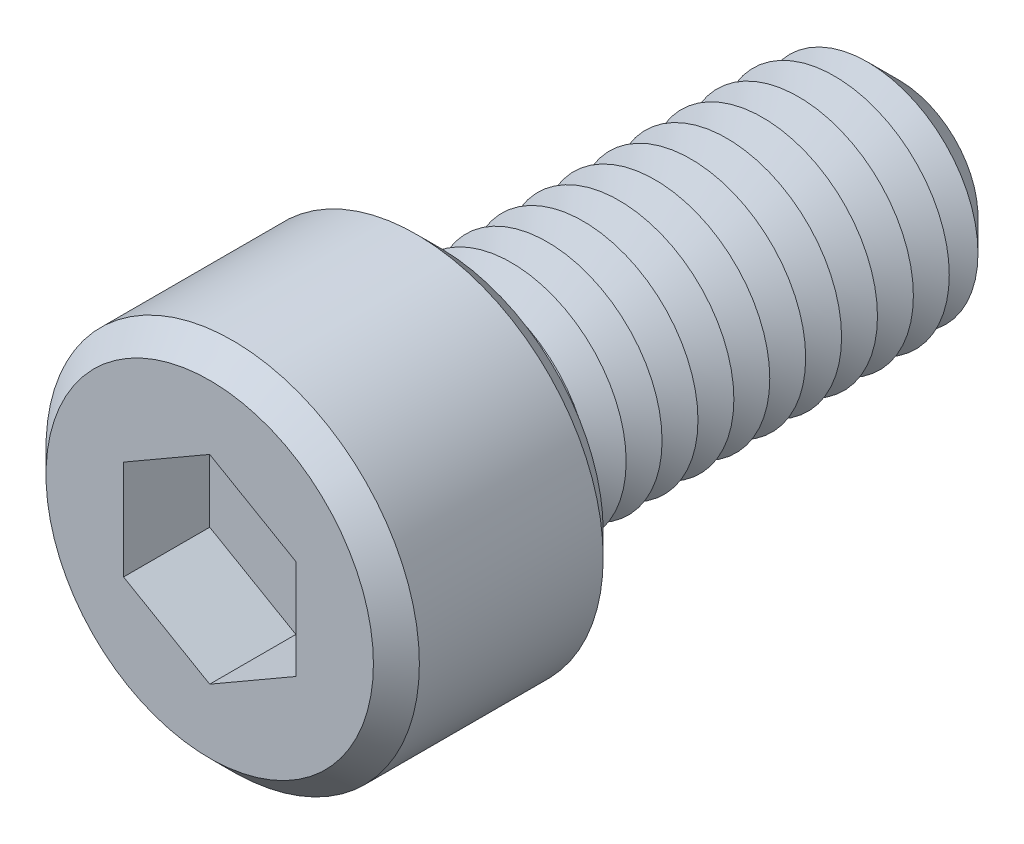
ISO-10303-21;
HEADER;
FILE_DESCRIPTION(('STEP AP214'),'2;1');
FILE_NAME('part.step','',(''),(''),'','','');
FILE_SCHEMA(('AUTOMOTIVE_DESIGN { 1 0 10303 214 1 1 1 1 }'));
ENDSEC;
DATA;
#1=APPLICATION_CONTEXT('core data for automotive mechanical design processes');
#2=APPLICATION_PROTOCOL_DEFINITION('international standard','automotive_design',2000,#1);
#3=PRODUCT_CONTEXT('',#1,'mechanical');
#4=PRODUCT('Part','Part','',(#3));
#5=PRODUCT_RELATED_PRODUCT_CATEGORY('part','',(#4));
#6=PRODUCT_DEFINITION_FORMATION('','',#4);
#7=PRODUCT_DEFINITION_CONTEXT('part definition',#1,'design');
#8=PRODUCT_DEFINITION('design','',#6,#7);
#9=PRODUCT_DEFINITION_SHAPE('','',#8);
#10=(LENGTH_UNIT() NAMED_UNIT(*) SI_UNIT(.MILLI.,.METRE.));
#11=(NAMED_UNIT(*) PLANE_ANGLE_UNIT() SI_UNIT($,.RADIAN.));
#12=(NAMED_UNIT(*) SI_UNIT($,.STERADIAN.) SOLID_ANGLE_UNIT());
#13=UNCERTAINTY_MEASURE_WITH_UNIT(LENGTH_MEASURE(1.E-05),#10,'distance_accuracy_value','');
#14=(GEOMETRIC_REPRESENTATION_CONTEXT(3) GLOBAL_UNCERTAINTY_ASSIGNED_CONTEXT((#13)) GLOBAL_UNIT_ASSIGNED_CONTEXT((#10,
#11,#12)) REPRESENTATION_CONTEXT('',''));
#15=CARTESIAN_POINT('',(0.,0.,0.));
#16=DIRECTION('',(0.,0.,1.));
#17=DIRECTION('',(1.,0.,0.));
#18=AXIS2_PLACEMENT_3D('',#15,#16,#17);
#19=CARTESIAN_POINT('',(0.,0.,8.));
#20=DIRECTION('',(0.,0.,-1.));
#21=DIRECTION('',(-1.,0.,0.));
#22=AXIS2_PLACEMENT_3D('',#19,#20,#21);
#23=CYLINDRICAL_SURFACE('',#22,6.5);
#24=CARTESIAN_POINT('',(0.,0.,0.800000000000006));
#25=DIRECTION('',(0.,0.,1.));
#26=DIRECTION('',(1.,0.,0.));
#27=AXIS2_PLACEMENT_3D('',#24,#25,#26);
#28=CIRCLE('',#27,6.5);
#29=CARTESIAN_POINT('',(6.5,0.,0.800000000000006));
#30=VERTEX_POINT('',#29);
#31=EDGE_CURVE('E272',#30,#30,#28,.T.);
#32=ORIENTED_EDGE('',*,*,#31,.T.);
#33=EDGE_LOOP('',(#32));
#34=FACE_BOUND('',#33,.T.);
#35=CARTESIAN_POINT('',(0.,0.,7.2));
#36=DIRECTION('',(0.,0.,1.));
#37=DIRECTION('',(1.,0.,0.));
#38=AXIS2_PLACEMENT_3D('',#35,#36,#37);
#39=CIRCLE('',#38,6.5);
#40=CARTESIAN_POINT('',(6.5,0.,7.2));
#41=VERTEX_POINT('',#40);
#42=EDGE_CURVE('E265',#41,#41,#39,.F.);
#43=ORIENTED_EDGE('',*,*,#42,.T.);
#44=EDGE_LOOP('',(#43));
#45=FACE_BOUND('',#44,.T.);
#46=ADVANCED_FACE('F39',(#34,#45),#23,.T.);
#47=CARTESIAN_POINT('',(0.,0.,8.));
#48=DIRECTION('',(0.,0.,1.));
#49=DIRECTION('',(1.,0.,0.));
#50=AXIS2_PLACEMENT_3D('',#47,#48,#49);
#51=PLANE('',#50);
#52=CARTESIAN_POINT('',(0.,0.,8.));
#53=DIRECTION('',(0.,0.,1.));
#54=DIRECTION('',(1.,0.,0.));
#55=AXIS2_PLACEMENT_3D('',#52,#53,#54);
#56=CIRCLE('',#55,5.70000000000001);
#57=CARTESIAN_POINT('',(5.70000000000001,0.,8.));
#58=VERTEX_POINT('',#57);
#59=EDGE_CURVE('E11',#58,#58,#56,.T.);
#60=ORIENTED_EDGE('',*,*,#59,.T.);
#61=EDGE_LOOP('',(#60));
#62=FACE_BOUND('',#61,.T.);
#63=DIRECTION('',(-0.866025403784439,0.5,0.));
#64=VECTOR('',#63,1.);
#65=CARTESIAN_POINT('',(3.,1.73205080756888,8.));
#66=LINE('',#65,#64);
#67=CARTESIAN_POINT('',(3.,1.73205080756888,8.));
#68=VERTEX_POINT('',#67);
#69=CARTESIAN_POINT('',(0.,3.46410161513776,8.));
#70=VERTEX_POINT('',#69);
#71=EDGE_CURVE('E55',#68,#70,#66,.T.);
#72=ORIENTED_EDGE('',*,*,#71,.F.);
#73=DIRECTION('',(0.,1.,0.));
#74=VECTOR('',#73,1.);
#75=CARTESIAN_POINT('',(3.,-1.73205080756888,8.));
#76=LINE('',#75,#74);
#77=CARTESIAN_POINT('',(3.,-1.73205080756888,8.));
#78=VERTEX_POINT('',#77);
#79=EDGE_CURVE('E150',#78,#68,#76,.T.);
#80=ORIENTED_EDGE('',*,*,#79,.F.);
#81=DIRECTION('',(0.866025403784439,0.5,0.));
#82=VECTOR('',#81,1.);
#83=CARTESIAN_POINT('',(0.,-3.46410161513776,8.));
#84=LINE('',#83,#82);
#85=CARTESIAN_POINT('',(0.,-3.46410161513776,8.));
#86=VERTEX_POINT('',#85);
#87=EDGE_CURVE('E147',#86,#78,#84,.T.);
#88=ORIENTED_EDGE('',*,*,#87,.F.);
#89=DIRECTION('',(0.866025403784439,-0.5,0.));
#90=VECTOR('',#89,1.);
#91=CARTESIAN_POINT('',(-3.,-1.73205080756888,8.));
#92=LINE('',#91,#90);
#93=CARTESIAN_POINT('',(-3.,-1.73205080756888,8.));
#94=VERTEX_POINT('',#93);
#95=EDGE_CURVE('E103',#94,#86,#92,.T.);
#96=ORIENTED_EDGE('',*,*,#95,.F.);
#97=DIRECTION('',(0.,-1.,0.));
#98=VECTOR('',#97,1.);
#99=CARTESIAN_POINT('',(-3.,1.73205080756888,8.));
#100=LINE('',#99,#98);
#101=CARTESIAN_POINT('',(-3.,1.73205080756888,8.));
#102=VERTEX_POINT('',#101);
#103=EDGE_CURVE('E141',#102,#94,#100,.T.);
#104=ORIENTED_EDGE('',*,*,#103,.F.);
#105=DIRECTION('',(-0.866025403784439,-0.5,0.));
#106=VECTOR('',#105,1.);
#107=CARTESIAN_POINT('',(0.,3.46410161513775,8.));
#108=LINE('',#107,#106);
#109=EDGE_CURVE('E136',#70,#102,#108,.T.);
#110=ORIENTED_EDGE('',*,*,#109,.F.);
#111=EDGE_LOOP('',(#72,#80,#88,#96,#104,#110));
#112=FACE_BOUND('',#111,.T.);
#113=ADVANCED_FACE('F290',(#62,#112),#51,.T.);
#114=CARTESIAN_POINT('',(0.,0.,0.));
#115=DIRECTION('',(0.,0.,1.));
#116=DIRECTION('',(1.,0.,0.));
#117=AXIS2_PLACEMENT_3D('',#114,#115,#116);
#118=PLANE('',#117);
#119=CARTESIAN_POINT('',(0.,0.,0.));
#120=DIRECTION('',(0.,0.,1.));
#121=DIRECTION('',(1.,0.,0.));
#122=AXIS2_PLACEMENT_3D('',#119,#120,#121);
#123=CIRCLE('',#122,5.69999999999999);
#124=CARTESIAN_POINT('',(5.69999999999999,0.,0.));
#125=VERTEX_POINT('',#124);
#126=EDGE_CURVE('E48',#125,#125,#123,.F.);
#127=ORIENTED_EDGE('',*,*,#126,.T.);
#128=EDGE_LOOP('',(#127));
#129=FACE_BOUND('',#128,.T.);
#130=CARTESIAN_POINT('',(0.,0.,0.));
#131=DIRECTION('',(0.,0.,1.));
#132=DIRECTION('',(1.,0.,0.));
#133=AXIS2_PLACEMENT_3D('',#130,#131,#132);
#134=CIRCLE('',#133,4.);
#135=CARTESIAN_POINT('',(4.,0.,0.));
#136=VERTEX_POINT('',#135);
#137=EDGE_CURVE('E258',#136,#136,#134,.T.);
#138=ORIENTED_EDGE('',*,*,#137,.T.);
#139=EDGE_LOOP('',(#138));
#140=FACE_BOUND('',#139,.T.);
#141=ADVANCED_FACE('F279',(#129,#140),#118,.F.);
#142=CARTESIAN_POINT('',(0.,0.,0.));
#143=DIRECTION('',(0.,0.,1.));
#144=DIRECTION('',(1.,0.,0.));
#145=AXIS2_PLACEMENT_3D('',#142,#143,#144);
#146=CONICAL_SURFACE('',#145,4.,1.0471975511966);
#147=CARTESIAN_POINT('',(0.,0.,-0.625000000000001));
#148=DIRECTION('',(0.,0.,1.));
#149=DIRECTION('',(1.,0.,0.));
#150=AXIS2_PLACEMENT_3D('',#147,#148,#149);
#151=CIRCLE('',#150,2.91746824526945);
#152=CARTESIAN_POINT('',(2.91746824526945,0.,-0.625000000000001));
#153=VERTEX_POINT('',#152);
#154=EDGE_CURVE('E254',#153,#153,#151,.T.);
#155=ORIENTED_EDGE('',*,*,#154,.T.);
#156=EDGE_LOOP('',(#155));
#157=FACE_BOUND('',#156,.T.);
#158=ORIENTED_EDGE('',*,*,#137,.F.);
#159=EDGE_LOOP('',(#158));
#160=FACE_BOUND('',#159,.T.);
#161=ADVANCED_FACE('F436',(#157,#160),#146,.T.);
#162=CARTESIAN_POINT('',(0.,0.,-0.625000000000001));
#163=DIRECTION('',(0.,0.,-1.));
#164=DIRECTION('',(-1.,0.,0.));
#165=AXIS2_PLACEMENT_3D('',#162,#163,#164);
#166=CONICAL_SURFACE('',#165,2.91746824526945,1.0471975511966);
#167=CARTESIAN_POINT('',(0.,0.,-1.25));
#168=DIRECTION('',(0.,0.,1.));
#169=DIRECTION('',(1.,0.,0.));
#170=AXIS2_PLACEMENT_3D('',#167,#168,#169);
#171=CIRCLE('',#170,4.);
#172=CARTESIAN_POINT('',(4.,0.,-1.25));
#173=VERTEX_POINT('',#172);
#174=EDGE_CURVE('E250',#173,#173,#171,.T.);
#175=ORIENTED_EDGE('',*,*,#174,.T.);
#176=EDGE_LOOP('',(#175));
#177=FACE_BOUND('',#176,.T.);
#178=ORIENTED_EDGE('',*,*,#154,.F.);
#179=EDGE_LOOP('',(#178));
#180=FACE_BOUND('',#179,.T.);
#181=ADVANCED_FACE('F432',(#177,#180),#166,.T.);
#182=CARTESIAN_POINT('',(0.,0.,-1.25));
#183=DIRECTION('',(0.,0.,1.));
#184=DIRECTION('',(1.,0.,0.));
#185=AXIS2_PLACEMENT_3D('',#182,#183,#184);
#186=CONICAL_SURFACE('',#185,4.,1.0471975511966);
#187=CARTESIAN_POINT('',(0.,0.,-1.875));
#188=DIRECTION('',(0.,0.,1.));
#189=DIRECTION('',(1.,0.,0.));
#190=AXIS2_PLACEMENT_3D('',#187,#188,#189);
#191=CIRCLE('',#190,2.91746824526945);
#192=CARTESIAN_POINT('',(2.91746824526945,0.,-1.875));
#193=VERTEX_POINT('',#192);
#194=EDGE_CURVE('E246',#193,#193,#191,.T.);
#195=ORIENTED_EDGE('',*,*,#194,.T.);
#196=EDGE_LOOP('',(#195));
#197=FACE_BOUND('',#196,.T.);
#198=ORIENTED_EDGE('',*,*,#174,.F.);
#199=EDGE_LOOP('',(#198));
#200=FACE_BOUND('',#199,.T.);
#201=ADVANCED_FACE('F428',(#197,#200),#186,.T.);
#202=CARTESIAN_POINT('',(0.,0.,-1.875));
#203=DIRECTION('',(0.,0.,-1.));
#204=DIRECTION('',(-1.,0.,0.));
#205=AXIS2_PLACEMENT_3D('',#202,#203,#204);
#206=CONICAL_SURFACE('',#205,2.91746824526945,1.0471975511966);
#207=CARTESIAN_POINT('',(0.,0.,-2.5));
#208=DIRECTION('',(0.,0.,1.));
#209=DIRECTION('',(1.,0.,0.));
#210=AXIS2_PLACEMENT_3D('',#207,#208,#209);
#211=CIRCLE('',#210,4.);
#212=CARTESIAN_POINT('',(4.,0.,-2.5));
#213=VERTEX_POINT('',#212);
#214=EDGE_CURVE('E242',#213,#213,#211,.T.);
#215=ORIENTED_EDGE('',*,*,#214,.T.);
#216=EDGE_LOOP('',(#215));
#217=FACE_BOUND('',#216,.T.);
#218=ORIENTED_EDGE('',*,*,#194,.F.);
#219=EDGE_LOOP('',(#218));
#220=FACE_BOUND('',#219,.T.);
#221=ADVANCED_FACE('F424',(#217,#220),#206,.T.);
#222=CARTESIAN_POINT('',(0.,0.,-2.5));
#223=DIRECTION('',(0.,0.,1.));
#224=DIRECTION('',(1.,0.,0.));
#225=AXIS2_PLACEMENT_3D('',#222,#223,#224);
#226=CONICAL_SURFACE('',#225,4.,1.0471975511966);
#227=CARTESIAN_POINT('',(0.,0.,-3.125));
#228=DIRECTION('',(0.,0.,1.));
#229=DIRECTION('',(1.,0.,0.));
#230=AXIS2_PLACEMENT_3D('',#227,#228,#229);
#231=CIRCLE('',#230,2.91746824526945);
#232=CARTESIAN_POINT('',(2.91746824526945,0.,-3.125));
#233=VERTEX_POINT('',#232);
#234=EDGE_CURVE('E238',#233,#233,#231,.T.);
#235=ORIENTED_EDGE('',*,*,#234,.T.);
#236=EDGE_LOOP('',(#235));
#237=FACE_BOUND('',#236,.T.);
#238=ORIENTED_EDGE('',*,*,#214,.F.);
#239=EDGE_LOOP('',(#238));
#240=FACE_BOUND('',#239,.T.);
#241=ADVANCED_FACE('F420',(#237,#240),#226,.T.);
#242=CARTESIAN_POINT('',(0.,0.,-3.125));
#243=DIRECTION('',(0.,0.,-1.));
#244=DIRECTION('',(-1.,0.,0.));
#245=AXIS2_PLACEMENT_3D('',#242,#243,#244);
#246=CONICAL_SURFACE('',#245,2.91746824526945,1.0471975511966);
#247=CARTESIAN_POINT('',(0.,0.,-3.75));
#248=DIRECTION('',(0.,0.,1.));
#249=DIRECTION('',(1.,0.,0.));
#250=AXIS2_PLACEMENT_3D('',#247,#248,#249);
#251=CIRCLE('',#250,4.);
#252=CARTESIAN_POINT('',(4.,0.,-3.75));
#253=VERTEX_POINT('',#252);
#254=EDGE_CURVE('E234',#253,#253,#251,.T.);
#255=ORIENTED_EDGE('',*,*,#254,.T.);
#256=EDGE_LOOP('',(#255));
#257=FACE_BOUND('',#256,.T.);
#258=ORIENTED_EDGE('',*,*,#234,.F.);
#259=EDGE_LOOP('',(#258));
#260=FACE_BOUND('',#259,.T.);
#261=ADVANCED_FACE('F416',(#257,#260),#246,.T.);
#262=CARTESIAN_POINT('',(0.,0.,-3.75));
#263=DIRECTION('',(0.,0.,1.));
#264=DIRECTION('',(1.,0.,0.));
#265=AXIS2_PLACEMENT_3D('',#262,#263,#264);
#266=CONICAL_SURFACE('',#265,4.,1.0471975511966);
#267=CARTESIAN_POINT('',(0.,0.,-4.375));
#268=DIRECTION('',(0.,0.,1.));
#269=DIRECTION('',(1.,0.,0.));
#270=AXIS2_PLACEMENT_3D('',#267,#268,#269);
#271=CIRCLE('',#270,2.91746824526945);
#272=CARTESIAN_POINT('',(2.91746824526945,0.,-4.375));
#273=VERTEX_POINT('',#272);
#274=EDGE_CURVE('E230',#273,#273,#271,.T.);
#275=ORIENTED_EDGE('',*,*,#274,.T.);
#276=EDGE_LOOP('',(#275));
#277=FACE_BOUND('',#276,.T.);
#278=ORIENTED_EDGE('',*,*,#254,.F.);
#279=EDGE_LOOP('',(#278));
#280=FACE_BOUND('',#279,.T.);
#281=ADVANCED_FACE('F412',(#277,#280),#266,.T.);
#282=CARTESIAN_POINT('',(0.,0.,-4.375));
#283=DIRECTION('',(0.,0.,-1.));
#284=DIRECTION('',(-1.,0.,0.));
#285=AXIS2_PLACEMENT_3D('',#282,#283,#284);
#286=CONICAL_SURFACE('',#285,2.91746824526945,1.0471975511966);
#287=CARTESIAN_POINT('',(0.,0.,-5.));
#288=DIRECTION('',(0.,0.,1.));
#289=DIRECTION('',(1.,0.,0.));
#290=AXIS2_PLACEMENT_3D('',#287,#288,#289);
#291=CIRCLE('',#290,4.);
#292=CARTESIAN_POINT('',(4.,0.,-5.));
#293=VERTEX_POINT('',#292);
#294=EDGE_CURVE('E226',#293,#293,#291,.T.);
#295=ORIENTED_EDGE('',*,*,#294,.T.);
#296=EDGE_LOOP('',(#295));
#297=FACE_BOUND('',#296,.T.);
#298=ORIENTED_EDGE('',*,*,#274,.F.);
#299=EDGE_LOOP('',(#298));
#300=FACE_BOUND('',#299,.T.);
#301=ADVANCED_FACE('F408',(#297,#300),#286,.T.);
#302=CARTESIAN_POINT('',(0.,0.,-5.));
#303=DIRECTION('',(0.,0.,1.));
#304=DIRECTION('',(1.,0.,0.));
#305=AXIS2_PLACEMENT_3D('',#302,#303,#304);
#306=CONICAL_SURFACE('',#305,4.,1.0471975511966);
#307=CARTESIAN_POINT('',(0.,0.,-5.625));
#308=DIRECTION('',(0.,0.,1.));
#309=DIRECTION('',(1.,0.,0.));
#310=AXIS2_PLACEMENT_3D('',#307,#308,#309);
#311=CIRCLE('',#310,2.91746824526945);
#312=CARTESIAN_POINT('',(2.91746824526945,0.,-5.625));
#313=VERTEX_POINT('',#312);
#314=EDGE_CURVE('E222',#313,#313,#311,.T.);
#315=ORIENTED_EDGE('',*,*,#314,.T.);
#316=EDGE_LOOP('',(#315));
#317=FACE_BOUND('',#316,.T.);
#318=ORIENTED_EDGE('',*,*,#294,.F.);
#319=EDGE_LOOP('',(#318));
#320=FACE_BOUND('',#319,.T.);
#321=ADVANCED_FACE('F404',(#317,#320),#306,.T.);
#322=CARTESIAN_POINT('',(0.,0.,-5.625));
#323=DIRECTION('',(0.,0.,-1.));
#324=DIRECTION('',(-1.,0.,0.));
#325=AXIS2_PLACEMENT_3D('',#322,#323,#324);
#326=CONICAL_SURFACE('',#325,2.91746824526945,1.0471975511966);
#327=CARTESIAN_POINT('',(0.,0.,-6.25));
#328=DIRECTION('',(0.,0.,1.));
#329=DIRECTION('',(1.,0.,0.));
#330=AXIS2_PLACEMENT_3D('',#327,#328,#329);
#331=CIRCLE('',#330,4.);
#332=CARTESIAN_POINT('',(4.,0.,-6.25));
#333=VERTEX_POINT('',#332);
#334=EDGE_CURVE('E218',#333,#333,#331,.T.);
#335=ORIENTED_EDGE('',*,*,#334,.T.);
#336=EDGE_LOOP('',(#335));
#337=FACE_BOUND('',#336,.T.);
#338=ORIENTED_EDGE('',*,*,#314,.F.);
#339=EDGE_LOOP('',(#338));
#340=FACE_BOUND('',#339,.T.);
#341=ADVANCED_FACE('F400',(#337,#340),#326,.T.);
#342=CARTESIAN_POINT('',(0.,0.,-6.25));
#343=DIRECTION('',(0.,0.,1.));
#344=DIRECTION('',(1.,0.,0.));
#345=AXIS2_PLACEMENT_3D('',#342,#343,#344);
#346=CONICAL_SURFACE('',#345,4.,1.0471975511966);
#347=CARTESIAN_POINT('',(0.,0.,-6.875));
#348=DIRECTION('',(0.,0.,1.));
#349=DIRECTION('',(1.,0.,0.));
#350=AXIS2_PLACEMENT_3D('',#347,#348,#349);
#351=CIRCLE('',#350,2.91746824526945);
#352=CARTESIAN_POINT('',(2.91746824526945,0.,-6.875));
#353=VERTEX_POINT('',#352);
#354=EDGE_CURVE('E214',#353,#353,#351,.T.);
#355=ORIENTED_EDGE('',*,*,#354,.T.);
#356=EDGE_LOOP('',(#355));
#357=FACE_BOUND('',#356,.T.);
#358=ORIENTED_EDGE('',*,*,#334,.F.);
#359=EDGE_LOOP('',(#358));
#360=FACE_BOUND('',#359,.T.);
#361=ADVANCED_FACE('F396',(#357,#360),#346,.T.);
#362=CARTESIAN_POINT('',(0.,0.,-6.875));
#363=DIRECTION('',(0.,0.,-1.));
#364=DIRECTION('',(-1.,0.,0.));
#365=AXIS2_PLACEMENT_3D('',#362,#363,#364);
#366=CONICAL_SURFACE('',#365,2.91746824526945,1.0471975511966);
#367=CARTESIAN_POINT('',(0.,0.,-7.5));
#368=DIRECTION('',(0.,0.,1.));
#369=DIRECTION('',(1.,0.,0.));
#370=AXIS2_PLACEMENT_3D('',#367,#368,#369);
#371=CIRCLE('',#370,4.);
#372=CARTESIAN_POINT('',(4.,0.,-7.5));
#373=VERTEX_POINT('',#372);
#374=EDGE_CURVE('E210',#373,#373,#371,.T.);
#375=ORIENTED_EDGE('',*,*,#374,.T.);
#376=EDGE_LOOP('',(#375));
#377=FACE_BOUND('',#376,.T.);
#378=ORIENTED_EDGE('',*,*,#354,.F.);
#379=EDGE_LOOP('',(#378));
#380=FACE_BOUND('',#379,.T.);
#381=ADVANCED_FACE('F392',(#377,#380),#366,.T.);
#382=CARTESIAN_POINT('',(0.,0.,-7.5));
#383=DIRECTION('',(0.,0.,1.));
#384=DIRECTION('',(1.,0.,0.));
#385=AXIS2_PLACEMENT_3D('',#382,#383,#384);
#386=CONICAL_SURFACE('',#385,4.,1.0471975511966);
#387=CARTESIAN_POINT('',(0.,0.,-8.125));
#388=DIRECTION('',(0.,0.,1.));
#389=DIRECTION('',(1.,0.,0.));
#390=AXIS2_PLACEMENT_3D('',#387,#388,#389);
#391=CIRCLE('',#390,2.91746824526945);
#392=CARTESIAN_POINT('',(2.91746824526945,0.,-8.125));
#393=VERTEX_POINT('',#392);
#394=EDGE_CURVE('E206',#393,#393,#391,.T.);
#395=ORIENTED_EDGE('',*,*,#394,.T.);
#396=EDGE_LOOP('',(#395));
#397=FACE_BOUND('',#396,.T.);
#398=ORIENTED_EDGE('',*,*,#374,.F.);
#399=EDGE_LOOP('',(#398));
#400=FACE_BOUND('',#399,.T.);
#401=ADVANCED_FACE('F388',(#397,#400),#386,.T.);
#402=CARTESIAN_POINT('',(0.,0.,-8.125));
#403=DIRECTION('',(0.,0.,-1.));
#404=DIRECTION('',(-1.,0.,0.));
#405=AXIS2_PLACEMENT_3D('',#402,#403,#404);
#406=CONICAL_SURFACE('',#405,2.91746824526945,1.0471975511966);
#407=CARTESIAN_POINT('',(0.,0.,-8.75));
#408=DIRECTION('',(0.,0.,1.));
#409=DIRECTION('',(1.,0.,0.));
#410=AXIS2_PLACEMENT_3D('',#407,#408,#409);
#411=CIRCLE('',#410,4.);
#412=CARTESIAN_POINT('',(4.,0.,-8.75));
#413=VERTEX_POINT('',#412);
#414=EDGE_CURVE('E202',#413,#413,#411,.T.);
#415=ORIENTED_EDGE('',*,*,#414,.T.);
#416=EDGE_LOOP('',(#415));
#417=FACE_BOUND('',#416,.T.);
#418=ORIENTED_EDGE('',*,*,#394,.F.);
#419=EDGE_LOOP('',(#418));
#420=FACE_BOUND('',#419,.T.);
#421=ADVANCED_FACE('F384',(#417,#420),#406,.T.);
#422=CARTESIAN_POINT('',(0.,0.,-8.75));
#423=DIRECTION('',(0.,0.,1.));
#424=DIRECTION('',(1.,0.,0.));
#425=AXIS2_PLACEMENT_3D('',#422,#423,#424);
#426=CONICAL_SURFACE('',#425,4.,1.0471975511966);
#427=CARTESIAN_POINT('',(0.,0.,-9.375));
#428=DIRECTION('',(0.,0.,1.));
#429=DIRECTION('',(1.,0.,0.));
#430=AXIS2_PLACEMENT_3D('',#427,#428,#429);
#431=CIRCLE('',#430,2.91746824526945);
#432=CARTESIAN_POINT('',(2.91746824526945,0.,-9.375));
#433=VERTEX_POINT('',#432);
#434=EDGE_CURVE('E198',#433,#433,#431,.T.);
#435=ORIENTED_EDGE('',*,*,#434,.T.);
#436=EDGE_LOOP('',(#435));
#437=FACE_BOUND('',#436,.T.);
#438=ORIENTED_EDGE('',*,*,#414,.F.);
#439=EDGE_LOOP('',(#438));
#440=FACE_BOUND('',#439,.T.);
#441=ADVANCED_FACE('F380',(#437,#440),#426,.T.);
#442=CARTESIAN_POINT('',(0.,0.,-9.375));
#443=DIRECTION('',(0.,0.,-1.));
#444=DIRECTION('',(-1.,0.,0.));
#445=AXIS2_PLACEMENT_3D('',#442,#443,#444);
#446=CONICAL_SURFACE('',#445,2.91746824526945,1.0471975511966);
#447=CARTESIAN_POINT('',(0.,0.,-10.));
#448=DIRECTION('',(0.,0.,1.));
#449=DIRECTION('',(1.,0.,0.));
#450=AXIS2_PLACEMENT_3D('',#447,#448,#449);
#451=CIRCLE('',#450,4.);
#452=CARTESIAN_POINT('',(4.,0.,-10.));
#453=VERTEX_POINT('',#452);
#454=EDGE_CURVE('E194',#453,#453,#451,.T.);
#455=ORIENTED_EDGE('',*,*,#454,.T.);
#456=EDGE_LOOP('',(#455));
#457=FACE_BOUND('',#456,.T.);
#458=ORIENTED_EDGE('',*,*,#434,.F.);
#459=EDGE_LOOP('',(#458));
#460=FACE_BOUND('',#459,.T.);
#461=ADVANCED_FACE('F376',(#457,#460),#446,.T.);
#462=CARTESIAN_POINT('',(0.,0.,-10.));
#463=DIRECTION('',(0.,0.,1.));
#464=DIRECTION('',(1.,0.,0.));
#465=AXIS2_PLACEMENT_3D('',#462,#463,#464);
#466=CONICAL_SURFACE('',#465,4.,1.0471975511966);
#467=CARTESIAN_POINT('',(0.,0.,-10.625));
#468=DIRECTION('',(0.,0.,1.));
#469=DIRECTION('',(1.,0.,0.));
#470=AXIS2_PLACEMENT_3D('',#467,#468,#469);
#471=CIRCLE('',#470,2.91746824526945);
#472=CARTESIAN_POINT('',(2.91746824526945,0.,-10.625));
#473=VERTEX_POINT('',#472);
#474=EDGE_CURVE('E190',#473,#473,#471,.T.);
#475=ORIENTED_EDGE('',*,*,#474,.T.);
#476=EDGE_LOOP('',(#475));
#477=FACE_BOUND('',#476,.T.);
#478=ORIENTED_EDGE('',*,*,#454,.F.);
#479=EDGE_LOOP('',(#478));
#480=FACE_BOUND('',#479,.T.);
#481=ADVANCED_FACE('F372',(#477,#480),#466,.T.);
#482=CARTESIAN_POINT('',(0.,0.,-10.625));
#483=DIRECTION('',(0.,0.,-1.));
#484=DIRECTION('',(-1.,0.,0.));
#485=AXIS2_PLACEMENT_3D('',#482,#483,#484);
#486=CONICAL_SURFACE('',#485,2.91746824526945,1.0471975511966);
#487=CARTESIAN_POINT('',(0.,0.,-11.25));
#488=DIRECTION('',(0.,0.,1.));
#489=DIRECTION('',(1.,0.,0.));
#490=AXIS2_PLACEMENT_3D('',#487,#488,#489);
#491=CIRCLE('',#490,4.);
#492=CARTESIAN_POINT('',(4.,0.,-11.25));
#493=VERTEX_POINT('',#492);
#494=EDGE_CURVE('E186',#493,#493,#491,.T.);
#495=ORIENTED_EDGE('',*,*,#494,.T.);
#496=EDGE_LOOP('',(#495));
#497=FACE_BOUND('',#496,.T.);
#498=ORIENTED_EDGE('',*,*,#474,.F.);
#499=EDGE_LOOP('',(#498));
#500=FACE_BOUND('',#499,.T.);
#501=ADVANCED_FACE('F368',(#497,#500),#486,.T.);
#502=CARTESIAN_POINT('',(0.,0.,-11.25));
#503=DIRECTION('',(0.,0.,1.));
#504=DIRECTION('',(1.,0.,0.));
#505=AXIS2_PLACEMENT_3D('',#502,#503,#504);
#506=CONICAL_SURFACE('',#505,4.,1.0471975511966);
#507=CARTESIAN_POINT('',(0.,0.,-11.875));
#508=DIRECTION('',(0.,0.,1.));
#509=DIRECTION('',(1.,0.,0.));
#510=AXIS2_PLACEMENT_3D('',#507,#508,#509);
#511=CIRCLE('',#510,2.91746824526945);
#512=CARTESIAN_POINT('',(2.91746824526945,0.,-11.875));
#513=VERTEX_POINT('',#512);
#514=EDGE_CURVE('E182',#513,#513,#511,.T.);
#515=ORIENTED_EDGE('',*,*,#514,.T.);
#516=EDGE_LOOP('',(#515));
#517=FACE_BOUND('',#516,.T.);
#518=ORIENTED_EDGE('',*,*,#494,.F.);
#519=EDGE_LOOP('',(#518));
#520=FACE_BOUND('',#519,.T.);
#521=ADVANCED_FACE('F364',(#517,#520),#506,.T.);
#522=CARTESIAN_POINT('',(0.,0.,-11.875));
#523=DIRECTION('',(0.,0.,-1.));
#524=DIRECTION('',(-1.,0.,0.));
#525=AXIS2_PLACEMENT_3D('',#522,#523,#524);
#526=CONICAL_SURFACE('',#525,2.91746824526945,1.0471975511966);
#527=CARTESIAN_POINT('',(0.,0.,-12.5));
#528=DIRECTION('',(0.,0.,1.));
#529=DIRECTION('',(1.,0.,0.));
#530=AXIS2_PLACEMENT_3D('',#527,#528,#529);
#531=CIRCLE('',#530,4.);
#532=CARTESIAN_POINT('',(4.,0.,-12.5));
#533=VERTEX_POINT('',#532);
#534=EDGE_CURVE('E178',#533,#533,#531,.T.);
#535=ORIENTED_EDGE('',*,*,#534,.T.);
#536=EDGE_LOOP('',(#535));
#537=FACE_BOUND('',#536,.T.);
#538=ORIENTED_EDGE('',*,*,#514,.F.);
#539=EDGE_LOOP('',(#538));
#540=FACE_BOUND('',#539,.T.);
#541=ADVANCED_FACE('F360',(#537,#540),#526,.T.);
#542=CARTESIAN_POINT('',(0.,0.,-12.5));
#543=DIRECTION('',(0.,0.,1.));
#544=DIRECTION('',(1.,0.,0.));
#545=AXIS2_PLACEMENT_3D('',#542,#543,#544);
#546=CONICAL_SURFACE('',#545,4.,1.0471975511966);
#547=CARTESIAN_POINT('',(0.,0.,-13.125));
#548=DIRECTION('',(0.,0.,1.));
#549=DIRECTION('',(1.,0.,0.));
#550=AXIS2_PLACEMENT_3D('',#547,#548,#549);
#551=CIRCLE('',#550,2.91746824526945);
#552=CARTESIAN_POINT('',(2.91746824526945,0.,-13.125));
#553=VERTEX_POINT('',#552);
#554=EDGE_CURVE('E174',#553,#553,#551,.T.);
#555=ORIENTED_EDGE('',*,*,#554,.T.);
#556=EDGE_LOOP('',(#555));
#557=FACE_BOUND('',#556,.T.);
#558=ORIENTED_EDGE('',*,*,#534,.F.);
#559=EDGE_LOOP('',(#558));
#560=FACE_BOUND('',#559,.T.);
#561=ADVANCED_FACE('F356',(#557,#560),#546,.T.);
#562=CARTESIAN_POINT('',(0.,0.,-13.125));
#563=DIRECTION('',(0.,0.,-1.));
#564=DIRECTION('',(-1.,0.,0.));
#565=AXIS2_PLACEMENT_3D('',#562,#563,#564);
#566=CONICAL_SURFACE('',#565,2.91746824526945,1.0471975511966);
#567=CARTESIAN_POINT('',(0.,0.,-13.75));
#568=DIRECTION('',(0.,0.,1.));
#569=DIRECTION('',(1.,0.,0.));
#570=AXIS2_PLACEMENT_3D('',#567,#568,#569);
#571=CIRCLE('',#570,4.);
#572=CARTESIAN_POINT('',(4.,0.,-13.75));
#573=VERTEX_POINT('',#572);
#574=EDGE_CURVE('E169',#573,#573,#571,.T.);
#575=ORIENTED_EDGE('',*,*,#574,.T.);
#576=EDGE_LOOP('',(#575));
#577=FACE_BOUND('',#576,.T.);
#578=ORIENTED_EDGE('',*,*,#554,.F.);
#579=EDGE_LOOP('',(#578));
#580=FACE_BOUND('',#579,.T.);
#581=ADVANCED_FACE('F352',(#577,#580),#566,.T.);
#582=CARTESIAN_POINT('',(0.,0.,-13.75));
#583=DIRECTION('',(0.,0.,1.));
#584=DIRECTION('',(1.,0.,0.));
#585=AXIS2_PLACEMENT_3D('',#582,#583,#584);
#586=CONICAL_SURFACE('',#585,4.,1.0471975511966);
#587=CARTESIAN_POINT('',(0.,0.,-14.375));
#588=DIRECTION('',(0.,0.,1.));
#589=DIRECTION('',(1.,0.,0.));
#590=AXIS2_PLACEMENT_3D('',#587,#588,#589);
#591=CIRCLE('',#590,2.91746824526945);
#592=CARTESIAN_POINT('',(2.91746824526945,0.,-14.375));
#593=VERTEX_POINT('',#592);
#594=EDGE_CURVE('E156',#593,#593,#591,.T.);
#595=ORIENTED_EDGE('',*,*,#594,.T.);
#596=EDGE_LOOP('',(#595));
#597=FACE_BOUND('',#596,.T.);
#598=ORIENTED_EDGE('',*,*,#574,.F.);
#599=EDGE_LOOP('',(#598));
#600=FACE_BOUND('',#599,.T.);
#601=ADVANCED_FACE('F348',(#597,#600),#586,.T.);
#602=CARTESIAN_POINT('',(0.,0.,-14.375));
#603=DIRECTION('',(0.,0.,-1.));
#604=DIRECTION('',(-1.,0.,0.));
#605=AXIS2_PLACEMENT_3D('',#602,#603,#604);
#606=CONICAL_SURFACE('',#605,2.91746824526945,1.0471975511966);
#607=CARTESIAN_POINT('',(0.,0.,-14.9084936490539));
#608=DIRECTION('',(0.,0.,-1.));
#609=DIRECTION('',(-1.,0.,0.));
#610=AXIS2_PLACEMENT_3D('',#607,#608,#609);
#611=CIRCLE('',#610,3.8415063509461);
#612=CARTESIAN_POINT('',(-3.8415063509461,0.,-14.9084936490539));
#613=VERTEX_POINT('',#612);
#614=EDGE_CURVE('E173',#613,#613,#611,.T.);
#615=ORIENTED_EDGE('',*,*,#614,.F.);
#616=EDGE_LOOP('',(#615));
#617=FACE_BOUND('',#616,.T.);
#618=ORIENTED_EDGE('',*,*,#594,.F.);
#619=EDGE_LOOP('',(#618));
#620=FACE_BOUND('',#619,.T.);
#621=ADVANCED_FACE('F344',(#617,#620),#606,.T.);
#622=CARTESIAN_POINT('',(0.,0.,-16.));
#623=DIRECTION('',(0.,0.,-1.));
#624=DIRECTION('',(-1.,0.,0.));
#625=AXIS2_PLACEMENT_3D('',#622,#623,#624);
#626=PLANE('',#625);
#627=CARTESIAN_POINT('',(0.,0.,-16.));
#628=DIRECTION('',(0.,0.,-1.));
#629=DIRECTION('',(-1.,0.,0.));
#630=AXIS2_PLACEMENT_3D('',#627,#628,#629);
#631=CIRCLE('',#630,0.9);
#632=CARTESIAN_POINT('',(-0.9,0.,-16.));
#633=VERTEX_POINT('',#632);
#634=EDGE_CURVE('E137',#633,#633,#631,.F.);
#635=ORIENTED_EDGE('',*,*,#634,.T.);
#636=EDGE_LOOP('',(#635));
#637=FACE_BOUND('',#636,.T.);
#638=CARTESIAN_POINT('',(0.,0.,-16.));
#639=DIRECTION('',(0.,0.,-1.));
#640=DIRECTION('',(-1.,0.,0.));
#641=AXIS2_PLACEMENT_3D('',#638,#639,#640);
#642=CIRCLE('',#641,2.75);
#643=CARTESIAN_POINT('',(-2.75,0.,-16.));
#644=VERTEX_POINT('',#643);
#645=EDGE_CURVE('E262',#644,#644,#642,.T.);
#646=ORIENTED_EDGE('',*,*,#645,.T.);
#647=EDGE_LOOP('',(#646));
#648=FACE_BOUND('',#647,.T.);
#649=ADVANCED_FACE('F347',(#637,#648),#626,.T.);
#650=CARTESIAN_POINT('',(0.,0.,-16.));
#651=DIRECTION('',(0.,0.,1.));
#652=DIRECTION('',(1.,0.,0.));
#653=AXIS2_PLACEMENT_3D('',#650,#651,#652);
#654=CONICAL_SURFACE('',#653,2.75,0.785398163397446);
#655=ORIENTED_EDGE('',*,*,#645,.F.);
#656=EDGE_LOOP('',(#655));
#657=FACE_BOUND('',#656,.T.);
#658=ORIENTED_EDGE('',*,*,#614,.T.);
#659=EDGE_LOOP('',(#658));
#660=FACE_BOUND('',#659,.T.);
#661=ADVANCED_FACE('F343',(#657,#660),#654,.T.);
#662=CARTESIAN_POINT('',(3.,1.73205080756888,5.));
#663=DIRECTION('',(0.5,0.866025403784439,0.));
#664=DIRECTION('',(-0.866025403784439,0.5,0.));
#665=AXIS2_PLACEMENT_3D('',#662,#663,#664);
#666=PLANE('',#665);
#667=ORIENTED_EDGE('',*,*,#71,.T.);
#668=DIRECTION('',(0.,0.,1.));
#669=VECTOR('',#668,1.);
#670=CARTESIAN_POINT('',(0.,3.46410161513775,5.));
#671=LINE('',#670,#669);
#672=CARTESIAN_POINT('',(0.,3.46410161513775,5.));
#673=VERTEX_POINT('',#672);
#674=EDGE_CURVE('E85',#673,#70,#671,.T.);
#675=ORIENTED_EDGE('',*,*,#674,.F.);
#676=DIRECTION('',(-0.866025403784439,0.5,0.));
#677=VECTOR('',#676,1.);
#678=CARTESIAN_POINT('',(3.,1.73205080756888,5.));
#679=LINE('',#678,#677);
#680=CARTESIAN_POINT('',(3.,1.73205080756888,5.));
#681=VERTEX_POINT('',#680);
#682=EDGE_CURVE('E153',#681,#673,#679,.T.);
#683=ORIENTED_EDGE('',*,*,#682,.F.);
#684=DIRECTION('',(0.,0.,1.));
#685=VECTOR('',#684,1.);
#686=CARTESIAN_POINT('',(3.,1.73205080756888,5.));
#687=LINE('',#686,#685);
#688=EDGE_CURVE('E63',#681,#68,#687,.T.);
#689=ORIENTED_EDGE('',*,*,#688,.T.);
#690=EDGE_LOOP('',(#667,#675,#683,#689));
#691=FACE_BOUND('',#690,.T.);
#692=ADVANCED_FACE('F333',(#691),#666,.F.);
#693=CARTESIAN_POINT('',(3.,-1.73205080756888,5.));
#694=DIRECTION('',(1.,0.,0.));
#695=DIRECTION('',(0.,1.,0.));
#696=AXIS2_PLACEMENT_3D('',#693,#694,#695);
#697=PLANE('',#696);
#698=ORIENTED_EDGE('',*,*,#79,.T.);
#699=ORIENTED_EDGE('',*,*,#688,.F.);
#700=DIRECTION('',(0.,1.,0.));
#701=VECTOR('',#700,1.);
#702=CARTESIAN_POINT('',(3.,-1.73205080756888,5.));
#703=LINE('',#702,#701);
#704=CARTESIAN_POINT('',(3.,-1.73205080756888,5.));
#705=VERTEX_POINT('',#704);
#706=EDGE_CURVE('E117',#705,#681,#703,.T.);
#707=ORIENTED_EDGE('',*,*,#706,.F.);
#708=DIRECTION('',(0.,0.,1.));
#709=VECTOR('',#708,1.);
#710=CARTESIAN_POINT('',(3.,-1.73205080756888,5.));
#711=LINE('',#710,#709);
#712=EDGE_CURVE('E108',#705,#78,#711,.T.);
#713=ORIENTED_EDGE('',*,*,#712,.T.);
#714=EDGE_LOOP('',(#698,#699,#707,#713));
#715=FACE_BOUND('',#714,.T.);
#716=ADVANCED_FACE('F330',(#715),#697,.F.);
#717=CARTESIAN_POINT('',(0.,-3.46410161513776,5.));
#718=DIRECTION('',(0.5,-0.866025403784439,0.));
#719=DIRECTION('',(0.866025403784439,0.5,0.));
#720=AXIS2_PLACEMENT_3D('',#717,#718,#719);
#721=PLANE('',#720);
#722=ORIENTED_EDGE('',*,*,#87,.T.);
#723=ORIENTED_EDGE('',*,*,#712,.F.);
#724=DIRECTION('',(0.866025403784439,0.5,0.));
#725=VECTOR('',#724,1.);
#726=CARTESIAN_POINT('',(0.,-3.46410161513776,5.));
#727=LINE('',#726,#725);
#728=CARTESIAN_POINT('',(0.,-3.46410161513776,5.));
#729=VERTEX_POINT('',#728);
#730=EDGE_CURVE('E112',#729,#705,#727,.T.);
#731=ORIENTED_EDGE('',*,*,#730,.F.);
#732=DIRECTION('',(0.,0.,1.));
#733=VECTOR('',#732,1.);
#734=CARTESIAN_POINT('',(0.,-3.46410161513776,5.));
#735=LINE('',#734,#733);
#736=EDGE_CURVE('E96',#729,#86,#735,.T.);
#737=ORIENTED_EDGE('',*,*,#736,.T.);
#738=EDGE_LOOP('',(#722,#723,#731,#737));
#739=FACE_BOUND('',#738,.T.);
#740=ADVANCED_FACE('F113',(#739),#721,.F.);
#741=CARTESIAN_POINT('',(-3.,-1.73205080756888,5.));
#742=DIRECTION('',(-0.5,-0.866025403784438,0.));
#743=DIRECTION('',(0.866025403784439,-0.5,0.));
#744=AXIS2_PLACEMENT_3D('',#741,#742,#743);
#745=PLANE('',#744);
#746=ORIENTED_EDGE('',*,*,#95,.T.);
#747=ORIENTED_EDGE('',*,*,#736,.F.);
#748=DIRECTION('',(0.866025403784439,-0.5,0.));
#749=VECTOR('',#748,1.);
#750=CARTESIAN_POINT('',(-3.,-1.73205080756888,5.));
#751=LINE('',#750,#749);
#752=CARTESIAN_POINT('',(-3.,-1.73205080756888,5.));
#753=VERTEX_POINT('',#752);
#754=EDGE_CURVE('E100',#753,#729,#751,.T.);
#755=ORIENTED_EDGE('',*,*,#754,.F.);
#756=DIRECTION('',(0.,0.,1.));
#757=VECTOR('',#756,1.);
#758=CARTESIAN_POINT('',(-3.,-1.73205080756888,5.));
#759=LINE('',#758,#757);
#760=EDGE_CURVE('E109',#753,#94,#759,.T.);
#761=ORIENTED_EDGE('',*,*,#760,.T.);
#762=EDGE_LOOP('',(#746,#747,#755,#761));
#763=FACE_BOUND('',#762,.T.);
#764=ADVANCED_FACE('F98',(#763),#745,.F.);
#765=CARTESIAN_POINT('',(-3.,1.73205080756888,5.));
#766=DIRECTION('',(-1.,0.,0.));
#767=DIRECTION('',(0.,0.,1.));
#768=AXIS2_PLACEMENT_3D('',#765,#766,#767);
#769=PLANE('',#768);
#770=ORIENTED_EDGE('',*,*,#103,.T.);
#771=ORIENTED_EDGE('',*,*,#760,.F.);
#772=DIRECTION('',(0.,-1.,0.));
#773=VECTOR('',#772,1.);
#774=CARTESIAN_POINT('',(-3.,1.73205080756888,5.));
#775=LINE('',#774,#773);
#776=CARTESIAN_POINT('',(-3.,1.73205080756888,5.));
#777=VERTEX_POINT('',#776);
#778=EDGE_CURVE('E123',#777,#753,#775,.T.);
#779=ORIENTED_EDGE('',*,*,#778,.F.);
#780=DIRECTION('',(0.,0.,1.));
#781=VECTOR('',#780,1.);
#782=CARTESIAN_POINT('',(-3.,1.73205080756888,5.));
#783=LINE('',#782,#781);
#784=EDGE_CURVE('E161',#777,#102,#783,.T.);
#785=ORIENTED_EDGE('',*,*,#784,.T.);
#786=EDGE_LOOP('',(#770,#771,#779,#785));
#787=FACE_BOUND('',#786,.T.);
#788=ADVANCED_FACE('F327',(#787),#769,.F.);
#789=CARTESIAN_POINT('',(0.,3.46410161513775,5.));
#790=DIRECTION('',(-0.5,0.866025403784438,0.));
#791=DIRECTION('',(-0.866025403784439,-0.5,0.));
#792=AXIS2_PLACEMENT_3D('',#789,#790,#791);
#793=PLANE('',#792);
#794=ORIENTED_EDGE('',*,*,#109,.T.);
#795=ORIENTED_EDGE('',*,*,#784,.F.);
#796=DIRECTION('',(-0.866025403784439,-0.5,0.));
#797=VECTOR('',#796,1.);
#798=CARTESIAN_POINT('',(0.,3.46410161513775,5.));
#799=LINE('',#798,#797);
#800=EDGE_CURVE('E128',#673,#777,#799,.T.);
#801=ORIENTED_EDGE('',*,*,#800,.F.);
#802=ORIENTED_EDGE('',*,*,#674,.T.);
#803=EDGE_LOOP('',(#794,#795,#801,#802));
#804=FACE_BOUND('',#803,.T.);
#805=ADVANCED_FACE('F305',(#804),#793,.F.);
#806=CARTESIAN_POINT('',(0.,0.,5.));
#807=DIRECTION('',(0.,0.,1.));
#808=DIRECTION('',(1.,0.,0.));
#809=AXIS2_PLACEMENT_3D('',#806,#807,#808);
#810=PLANE('',#809);
#811=CARTESIAN_POINT('',(0.,0.,5.));
#812=DIRECTION('',(0.,0.,1.));
#813=DIRECTION('',(1.,0.,0.));
#814=AXIS2_PLACEMENT_3D('',#811,#812,#813);
#815=CIRCLE('',#814,0.9);
#816=CARTESIAN_POINT('',(0.9,0.,5.));
#817=VERTEX_POINT('',#816);
#818=EDGE_CURVE('E313',#817,#817,#815,.T.);
#819=ORIENTED_EDGE('',*,*,#818,.F.);
#820=EDGE_LOOP('',(#819));
#821=FACE_BOUND('',#820,.T.);
#822=ORIENTED_EDGE('',*,*,#682,.T.);
#823=ORIENTED_EDGE('',*,*,#800,.T.);
#824=ORIENTED_EDGE('',*,*,#778,.T.);
#825=ORIENTED_EDGE('',*,*,#754,.T.);
#826=ORIENTED_EDGE('',*,*,#730,.T.);
#827=ORIENTED_EDGE('',*,*,#706,.T.);
#828=EDGE_LOOP('',(#822,#823,#824,#825,#826,#827));
#829=FACE_BOUND('',#828,.T.);
#830=ADVANCED_FACE('F120',(#821,#829),#810,.T.);
#831=CARTESIAN_POINT('',(0.,0.,-18.5455844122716));
#832=DIRECTION('',(0.,0.,1.));
#833=DIRECTION('',(1.,0.,0.));
#834=AXIS2_PLACEMENT_3D('',#831,#832,#833);
#835=CYLINDRICAL_SURFACE('',#834,0.9);
#836=ORIENTED_EDGE('',*,*,#818,.T.);
#837=EDGE_LOOP('',(#836));
#838=FACE_BOUND('',#837,.T.);
#839=ORIENTED_EDGE('',*,*,#634,.F.);
#840=EDGE_LOOP('',(#839));
#841=FACE_BOUND('',#840,.T.);
#842=ADVANCED_FACE('F285',(#838,#841),#835,.F.);
#843=CARTESIAN_POINT('',(0.,0.,0.800000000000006));
#844=DIRECTION('',(0.,0.,1.));
#845=DIRECTION('',(1.,0.,0.));
#846=AXIS2_PLACEMENT_3D('',#843,#844,#845);
#847=CONICAL_SURFACE('',#846,6.5,0.785398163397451);
#848=ORIENTED_EDGE('',*,*,#126,.F.);
#849=EDGE_LOOP('',(#848));
#850=FACE_BOUND('',#849,.T.);
#851=ORIENTED_EDGE('',*,*,#31,.F.);
#852=EDGE_LOOP('',(#851));
#853=FACE_BOUND('',#852,.T.);
#854=ADVANCED_FACE('F282',(#850,#853),#847,.T.);
#855=CARTESIAN_POINT('',(0.,0.,8.));
#856=DIRECTION('',(0.,0.,-1.));
#857=DIRECTION('',(-1.,0.,0.));
#858=AXIS2_PLACEMENT_3D('',#855,#856,#857);
#859=CONICAL_SURFACE('',#858,5.70000000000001,0.785398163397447);
#860=ORIENTED_EDGE('',*,*,#42,.F.);
#861=EDGE_LOOP('',(#860));
#862=FACE_BOUND('',#861,.T.);
#863=ORIENTED_EDGE('',*,*,#59,.F.);
#864=EDGE_LOOP('',(#863));
#865=FACE_BOUND('',#864,.T.);
#866=ADVANCED_FACE('F41',(#862,#865),#859,.T.);
#867=CLOSED_SHELL('',(#46,#113,#141,#161,#181,#201,#221,#241,#261,#281,#301,#321,#341,#361,#381,
#401,#421,#441,#461,#481,#501,#521,#541,#561,#581,#601,#621,#649,#661,#692,#716,#740,#764,#788,
#805,#830,#842,#854,#866));
#868=MANIFOLD_SOLID_BREP('B2',#867);
#869=ADVANCED_BREP_SHAPE_REPRESENTATION('',(#18,#868),#14);
#870=SHAPE_DEFINITION_REPRESENTATION(#9,#869);
ENDSEC;
END-ISO-10303-21;
